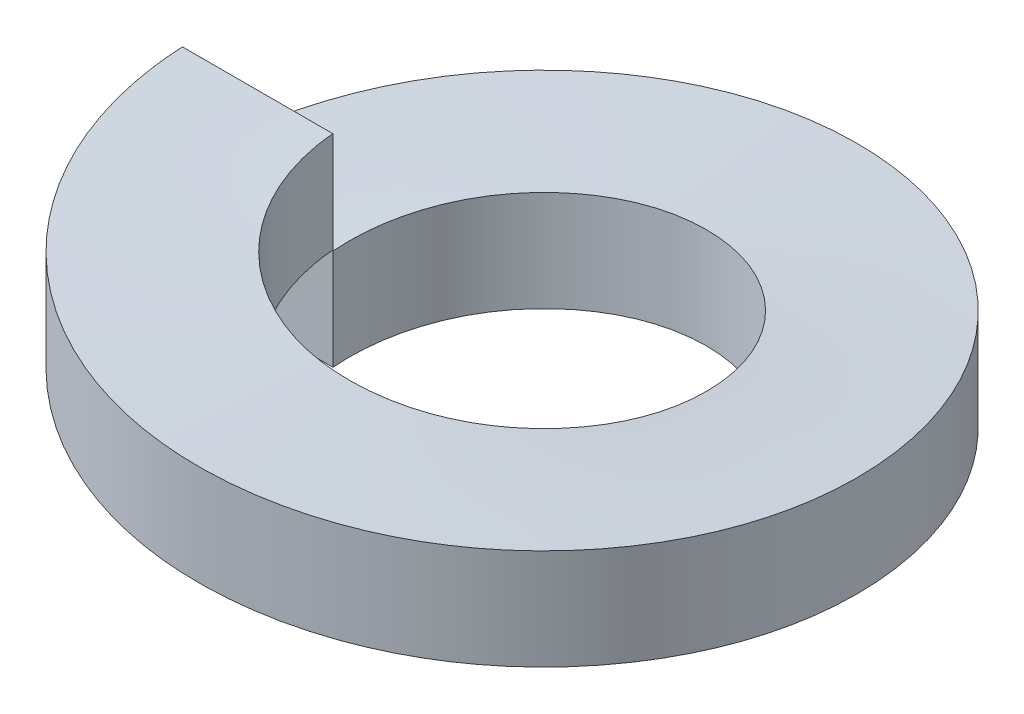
from build123d import *

# Parameters (mm, degrees)
SWEEP1_PITCH       = 1.03
SWEEP1_HEIGHT      = 1.03
SWEEP1_RADIUS      = 2.5781
SWEEP1_START_ANGLE = -90
SKETCH2_W          = 1.524
SKETCH2_H          = 1.02


with BuildPart() as part:
    # Sweep1: sweep along a helix
    with BuildLine() as sweep1_path:
        add(Helix(SWEEP1_PITCH, SWEEP1_HEIGHT, SWEEP1_RADIUS, center=(0, 0, 0), direction=(0, 1, 0), lefthand=True, mode=Mode.PRIVATE).rotate(Axis((0, 0, 0), (0, 1, 0)), SWEEP1_START_ANGLE))
    # Sketch2 → Sweep1 (sweep)
    with BuildSketch(Plane.XY):
        with Locations((-2.5781, 0.51)):
            Rectangle(SKETCH2_W, SKETCH2_H)
    sweep(path=sweep1_path.line, is_frenet=True)


solid = part.part
